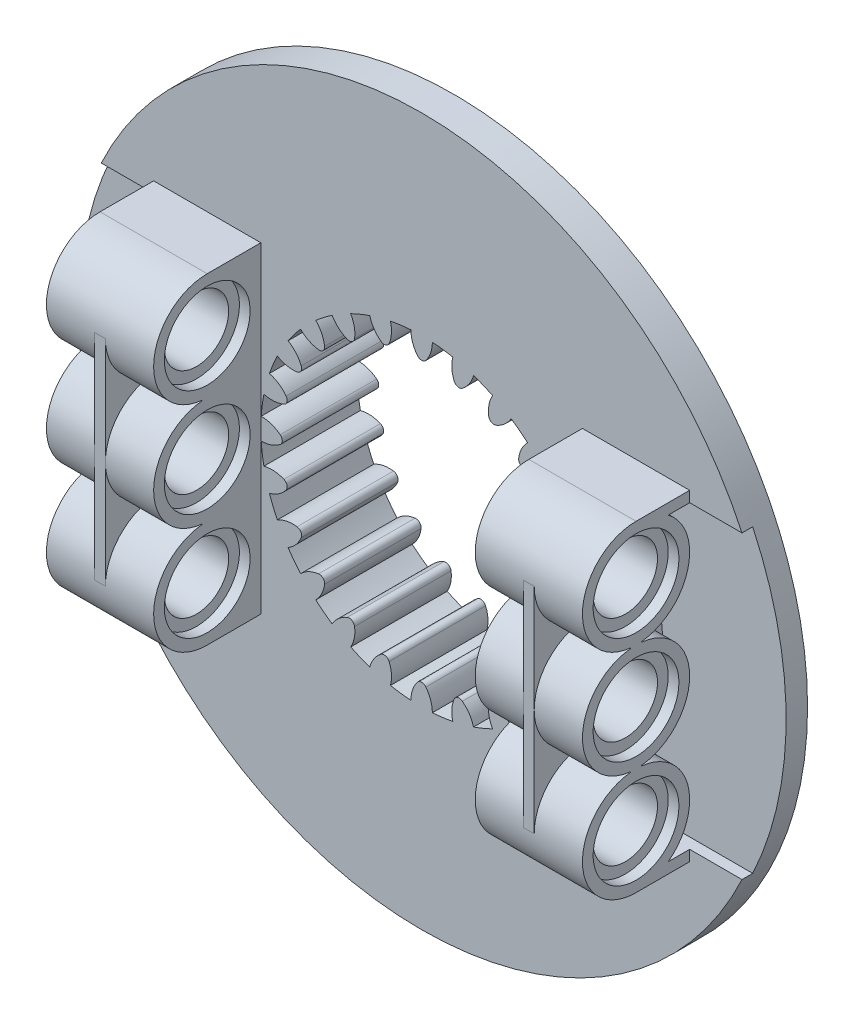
from build123d import *

# Parameters (mm, degrees)
CROQUIS1_R              = 26.4
EXTRUIR1_DEPTH          = 0.8
SALIENTE_EXTRUIR1_START = 0.8
CROQUIS4_R              = 26.4
SALIENTE_EXTRUIR1_DEPTH = 0.8
CORTAR_EXTRUIR2_DEPTH   = 0.8
SALIENTE_EXTRUIR3_DEPTH = 4
SALIENTE_EXTRUIR4_DEPTH = 8
CROQUIS7_R              = 3.2
CORTAR_EXTRUIR3_DEPTH   = 0.8
CORTAR_EXTRUIR4_START   = -0.8
CROQUIS8_R              = 3.2
CORTAR_EXTRUIR4_DEPTH   = 0.8
CROQUIS9_W              = 0.8
CROQUIS9_H              = 24
SALIENTE_EXTRUIR5_DEPTH = 3.6
CORTAR_EXTRUIR5_REACH   = 56.241
CROQUIS10_R             = 2.4
CROQUIS3_R              = 14
SALIENTE_EXTRUIR6_DEPTH = 4.8
CORTAR_EXTRUIR7_REACH   = 42.311
CROQUIS12_R             = 12
SALIENTE_EXTRUIR7_DEPTH = 7.2
MATRIZC1_COUNT          = 24


with BuildPart() as part:
    # Croquis1 → Extruir1 (new, symmetric)
    with BuildSketch(Plane.XY):
        Circle(CROQUIS1_R)
    extrude(amount=EXTRUIR1_DEPTH, both=True)

    # Croquis4 → Saliente-Extruir1 (add)
    with BuildSketch(Plane.XY.offset(0.8).offset(SALIENTE_EXTRUIR1_START)):
        Circle(CROQUIS4_R)
    extrude(amount=-SALIENTE_EXTRUIR1_DEPTH)

    # Croquis5 → Cortar-Extruir2 (cut)
    with BuildSketch(Plane.XY.offset(1.6)):
        with BuildLine():
            Line((13.053735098, -11.2), (23.906484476, -11.2))
            ThreePointArc((23.906484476, -11.2), (26.4, 0), (23.906484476, 11.2))
            Line((23.906484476, 11.2), (13.053735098, 11.2))
            ThreePointArc((13.053735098, 11.2), (17.2, 0), (13.053735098, -11.2))
        make_face()
    cortar_extruir2 = extrude(amount=-CORTAR_EXTRUIR2_DEPTH, mode=Mode.SUBTRACT)

    # Croquis6 → Saliente-Extruir3 (add)
    with BuildSketch(Plane(origin=(12, 0, 0), x_dir=(0, 0, -1), z_dir=(1, 0, 0))):
        with BuildLine():
            Line((-5.2, -3.979949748), (-5.2, -4.020050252))
            ThreePointArc((-5.2, -4.020050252), (-1.746700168, -6.926649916), (-3.2, -11.2))
            Line((-3.2, -11.2), (-1.6, -11.2))
            Line((-1.6, -11.2), (-1.6, -12))
            Line((-1.6, -12), (-5.6, -12))
            Line((-5.6, -12), (-5.6, 12))
            Line((-5.6, 12), (-1.6, 12))
            Line((-1.6, 12), (-1.6, 11.2))
            Line((-1.6, 11.2), (-3.2, 11.2))
            ThreePointArc((-3.2, 11.2), (-1.746700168, 6.926649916), (-5.2, 4.020050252))
            Line((-5.2, 4.020050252), (-5.2, 3.979949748))
            ThreePointArc((-5.2, 3.979949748), (-2.771572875, 2.828427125), (-1.620050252, 0.4))
            Line((-1.620050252, 0.4), (-1.6, 0.4))
            Line((-1.6, 0.4), (-1.6, -0.4))
            Line((-1.6, -0.4), (-1.620050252, -0.4))
            ThreePointArc((-1.620050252, -0.4), (-2.771572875, -2.828427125), (-5.2, -3.979949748))
        make_face()
        with BuildLine():
            ThreePointArc((-1.6, 8), (-2.633520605, 5.316718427), (-5.2, 4.020050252))
            Line((-5.2, 4.020050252), (-5.2, 3.979949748))
            ThreePointArc((-5.2, 3.979949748), (-2.771572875, 2.828427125), (-1.620050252, 0.4))
            Line((-1.620050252, 0.4), (-1.6, 0.4))
            Line((-1.6, 0.4), (-1.6, 8))
        make_face()
        with BuildLine():
            ThreePointArc((-3.2, 11.2), (-2.022291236, 9.788854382), (-1.6, 8))
            Line((-1.6, 8), (-1.6, 11.2))
            Line((-1.6, 11.2), (-3.2, 11.2))
        make_face()
        with BuildLine():
            Line((-1.6, -8.00000001), (-1.6, -0.4))
            Line((-1.6, -0.4), (-1.620050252, -0.4))
            ThreePointArc((-1.620050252, -0.4), (-2.771572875, -2.828427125), (-5.2, -3.979949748))
            Line((-5.2, -3.979949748), (-5.2, -4.020050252))
            ThreePointArc((-5.2, -4.020050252), (-2.633520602, -5.316718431), (-1.6, -8.00000001))
        make_face()
        with BuildLine():
            Line((-1.6, -11.2), (-1.6, -8.00000001))
            ThreePointArc((-1.6, -8.00000001), (-2.022291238, -9.788854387), (-3.2, -11.2))
            Line((-3.2, -11.2), (-1.6, -11.2))
        make_face()
    saliente_extruir3 = extrude(amount=SALIENTE_EXTRUIR3_DEPTH)

    # Croquis6_3 → Saliente-Extruir4 (add)
    with BuildSketch(Plane(origin=(12, 0, 0), x_dir=(0, 0, -1), z_dir=(1, 0, 0))):
        with BuildLine():
            Line((-5.6, 12), (-5.6, -12))
            ThreePointArc((-5.6, -12), (-9.594984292, -8.2002511), (-6, -4.020050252))
            Line((-6, -4.020050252), (-6, -3.979949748))
            ThreePointArc((-6, -3.979949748), (-9.6, 0), (-6, 3.979949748))
            Line((-6, 3.979949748), (-6, 4.020050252))
            ThreePointArc((-6, 4.020050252), (-9.594984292, 8.2002511), (-5.6, 12))
        make_face()
        with BuildLine():
            Line((-5.2, -3.979949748), (-5.2, -4.020050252))
            ThreePointArc((-5.2, -4.020050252), (-1.746700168, -6.926649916), (-3.2, -11.2))
            Line((-3.2, -11.2), (-1.6, -11.2))
            Line((-1.6, -11.2), (-1.6, -12))
            Line((-1.6, -12), (-5.6, -12))
            Line((-5.6, -12), (-5.6, 12))
            Line((-5.6, 12), (-1.6, 12))
            Line((-1.6, 12), (-1.6, 11.2))
            Line((-1.6, 11.2), (-3.2, 11.2))
            ThreePointArc((-3.2, 11.2), (-1.746700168, 6.926649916), (-5.2, 4.020050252))
            Line((-5.2, 4.020050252), (-5.2, 3.979949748))
            ThreePointArc((-5.2, 3.979949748), (-2.771572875, 2.828427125), (-1.620050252, 0.4))
            Line((-1.620050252, 0.4), (-1.6, 0.4))
            Line((-1.6, 0.4), (-1.6, -0.4))
            Line((-1.6, -0.4), (-1.620050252, -0.4))
            ThreePointArc((-1.620050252, -0.4), (-2.771572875, -2.828427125), (-5.2, -3.979949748))
        make_face()
    saliente_extruir4 = extrude(amount=SALIENTE_EXTRUIR4_DEPTH)

    # Croquis7 → Cortar-Extruir3 (cut)
    with BuildSketch(Plane(origin=(20, 0, 0), x_dir=(0, 0, -1), z_dir=(1, 0, 0))):
        with Locations((-5.6, 8)):
            Circle(CROQUIS7_R)
        with Locations((-5.6, 0)):
            Circle(CROQUIS7_R)
        with Locations((-5.6, -8)):
            Circle(CROQUIS7_R)
    cortar_extruir3 = extrude(amount=-CORTAR_EXTRUIR3_DEPTH, mode=Mode.SUBTRACT)

    # Croquis8 → Cortar-Extruir4 (cut)
    with BuildSketch(Plane.ZY.offset(-12).offset(CORTAR_EXTRUIR4_START)):
        with Locations(Location((5.6, 8, 0), (0, 0, 180))):
            Circle(CROQUIS8_R)
        with Locations(Location((5.6, 0, 0), (0, 0, 180))):
            Circle(CROQUIS8_R)
        with Locations(Location((5.6, -8, 0), (0, 0, 180))):
            Circle(CROQUIS8_R)
    cortar_extruir4 = extrude(amount=CORTAR_EXTRUIR4_DEPTH, mode=Mode.SUBTRACT)

    # Croquis9 → Saliente-Extruir5 (add)
    with BuildSketch(Plane.XY.offset(6)):
        with Locations((16, 0)):
            Rectangle(CROQUIS9_W, CROQUIS9_H)
    saliente_extruir5 = extrude(amount=SALIENTE_EXTRUIR5_DEPTH)

    # Croquis10 → Cortar-Extruir5 (cut, up to next)
    with BuildSketch(Plane(origin=(20, 0, 0), x_dir=(0, 0, -1), z_dir=(1, 0, 0)), mode=Mode.PRIVATE) as cortar_extruir5_sk1:
        with Locations((-5.6, 8)):
            Circle(CROQUIS10_R)
    cortar_extruir5_tool1 = extrude(cortar_extruir5_sk1.sketch, amount=-CORTAR_EXTRUIR5_REACH, mode=Mode.PRIVATE) & part.part
    # Croquis10 → Cortar-Extruir5 (cut, up to next)
    with BuildSketch(Plane(origin=(20, 0, 0), x_dir=(0, 0, -1), z_dir=(1, 0, 0)), mode=Mode.PRIVATE) as cortar_extruir5_sk2:
        with Locations((-5.6, 0)):
            Circle(CROQUIS10_R)
    cortar_extruir5_tool2 = extrude(cortar_extruir5_sk2.sketch, amount=-CORTAR_EXTRUIR5_REACH, mode=Mode.PRIVATE) & part.part
    # Croquis10 → Cortar-Extruir5 (cut, up to next)
    with BuildSketch(Plane(origin=(20, 0, 0), x_dir=(0, 0, -1), z_dir=(1, 0, 0)), mode=Mode.PRIVATE) as cortar_extruir5_sk3:
        with Locations((-5.6, -8)):
            Circle(CROQUIS10_R)
    cortar_extruir5_tool3 = extrude(cortar_extruir5_sk3.sketch, amount=-CORTAR_EXTRUIR5_REACH, mode=Mode.PRIVATE) & part.part
    # Croquis10 → Cortar-Extruir5 (cut, up to next)
    with BuildSketch(Plane(origin=(20, 0, 0), x_dir=(0, 0, -1), z_dir=(1, 0, 0)), mode=Mode.PRIVATE) as cortar_extruir5_sk4:
        with BuildLine():
            Line((-9.6, 12), (-9.6, 8))
            ThreePointArc((-9.6, 8), (-8.566479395, 10.683281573), (-6, 11.979949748))
            Line((-6, 11.979949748), (-6, 12))
            Line((-6, 12), (-9.6, 12))
        make_face()
    cortar_extruir5_tool4 = extrude(cortar_extruir5_sk4.sketch, amount=-CORTAR_EXTRUIR5_REACH, mode=Mode.PRIVATE) & part.part
    # Croquis10 → Cortar-Extruir5 (cut, up to next)
    with BuildSketch(Plane(origin=(20, 0, 0), x_dir=(0, 0, -1), z_dir=(1, 0, 0)), mode=Mode.PRIVATE) as cortar_extruir5_sk5:
        with BuildLine():
            Line((-6, -12), (-6, -11.979949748))
            ThreePointArc((-6, -11.979949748), (-8.566479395, -10.683281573), (-9.6, -8))
            Line((-9.6, -8), (-9.6, -12))
            Line((-9.6, -12), (-6, -12))
        make_face()
    cortar_extruir5_tool5 = extrude(cortar_extruir5_sk5.sketch, amount=-CORTAR_EXTRUIR5_REACH, mode=Mode.PRIVATE) & part.part
    cortar_extruir5_1 = cortar_extruir5_tool1.solids().sort_by_distance((20, 8, 5.6))[0]
    add(cortar_extruir5_1, mode=Mode.SUBTRACT)
    cortar_extruir5_2 = cortar_extruir5_tool2.solids().sort_by_distance((20, 0, 5.6))[0]
    add(cortar_extruir5_2, mode=Mode.SUBTRACT)
    cortar_extruir5_3 = cortar_extruir5_tool3.solids().sort_by_distance((20, -8, 5.6))[0]
    add(cortar_extruir5_3, mode=Mode.SUBTRACT)
    cortar_extruir5_4 = cortar_extruir5_tool4.solids().sort_by_distance((20, 11.105837, 8.708713))[0]
    add(cortar_extruir5_4, mode=Mode.SUBTRACT)
    cortar_extruir5_5 = cortar_extruir5_tool5.solids().sort_by_distance((20, -11.105837, 8.708713))[0]
    add(cortar_extruir5_5, mode=Mode.SUBTRACT)
    cortar_extruir5 = cortar_extruir5_1 + cortar_extruir5_2 + cortar_extruir5_3 + cortar_extruir5_4 + cortar_extruir5_5  # Cortar-Extruir5 as one shape, for the pattern or mirror that repeats it

    # Simetr_a1: Cortar-Extruir2, Saliente-Extruir3, Saliente-Extruir4, Cortar-Extruir3, Cortar-Extruir4, Saliente-Extruir5, Cortar-Extruir5 across plane
    add(cortar_extruir2.mirror(Plane(origin=(0, 0, 0), x_dir=(0, 0, 1), z_dir=(1, 0, 0))), mode=Mode.SUBTRACT)
    add(saliente_extruir3.mirror(Plane(origin=(0, 0, 0), x_dir=(0, 0, 1), z_dir=(1, 0, 0))))
    add(saliente_extruir4.mirror(Plane(origin=(0, 0, 0), x_dir=(0, 0, 1), z_dir=(1, 0, 0))))
    add(cortar_extruir3.mirror(Plane(origin=(0, 0, 0), x_dir=(0, 0, 1), z_dir=(1, 0, 0))), mode=Mode.SUBTRACT)
    add(cortar_extruir4.mirror(Plane(origin=(0, 0, 0), x_dir=(0, 0, 1), z_dir=(1, 0, 0))), mode=Mode.SUBTRACT)
    add(saliente_extruir5.mirror(Plane(origin=(0, 0, 0), x_dir=(0, 0, 1), z_dir=(1, 0, 0))))
    add(cortar_extruir5.mirror(Plane(origin=(0, 0, 0), x_dir=(0, 0, 1), z_dir=(1, 0, 0))), mode=Mode.SUBTRACT)

    # Croquis3 → Saliente-Extruir6 (add)
    with BuildSketch(Plane.XY.offset(-0.8)):
        Circle(CROQUIS3_R)
    extrude(amount=-SALIENTE_EXTRUIR6_DEPTH)

    # Croquis12 → Cortar-Extruir7 (cut, up to next)
    with BuildSketch(Plane(origin=(0, 0, -5.6), x_dir=(-1, 0, 0), z_dir=(0, 0, -1)), mode=Mode.PRIVATE) as cortar_extruir7_sk1:
        Circle(CROQUIS12_R)
    cortar_extruir7_tool1 = extrude(cortar_extruir7_sk1.sketch, amount=-CORTAR_EXTRUIR7_REACH, mode=Mode.PRIVATE) & part.part
    add(cortar_extruir7_tool1.solids().sort_by_distance((0, 0, -5.6))[0], mode=Mode.SUBTRACT)

    # Croquis13 → Saliente-Extruir7 (add)
    with BuildSketch(Plane(origin=(0, 0, -5.6), x_dir=(-1, 0, 0), z_dir=(0, 0, -1))):
        with BuildLine():
            ThreePointArc((0.8, 11.973303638), (0, 12), (-0.8, 11.973303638))
            ThreePointArc((-0.8, 11.973303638), (-0.675854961, 11.224424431), (-0.316701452, 10.555663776))
            ThreePointArc((-0.316701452, 10.555663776), (0, 10.4), (0.316701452, 10.555663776))
            ThreePointArc((0.316701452, 10.555663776), (0.675854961, 11.224424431), (0.8, 11.973303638))
        make_face()
    saliente_extruir7 = extrude(amount=-SALIENTE_EXTRUIR7_DEPTH)

    # MatrizC1: Saliente-Extruir7 ×24 about axis
    matrizc1_axis = Axis((0, 0, 0), (0, 0, 1))
    for i in range(1, MATRIZC1_COUNT):
        add(saliente_extruir7.rotate(matrizc1_axis, i * 360 / MATRIZC1_COUNT))


solid = part.part
